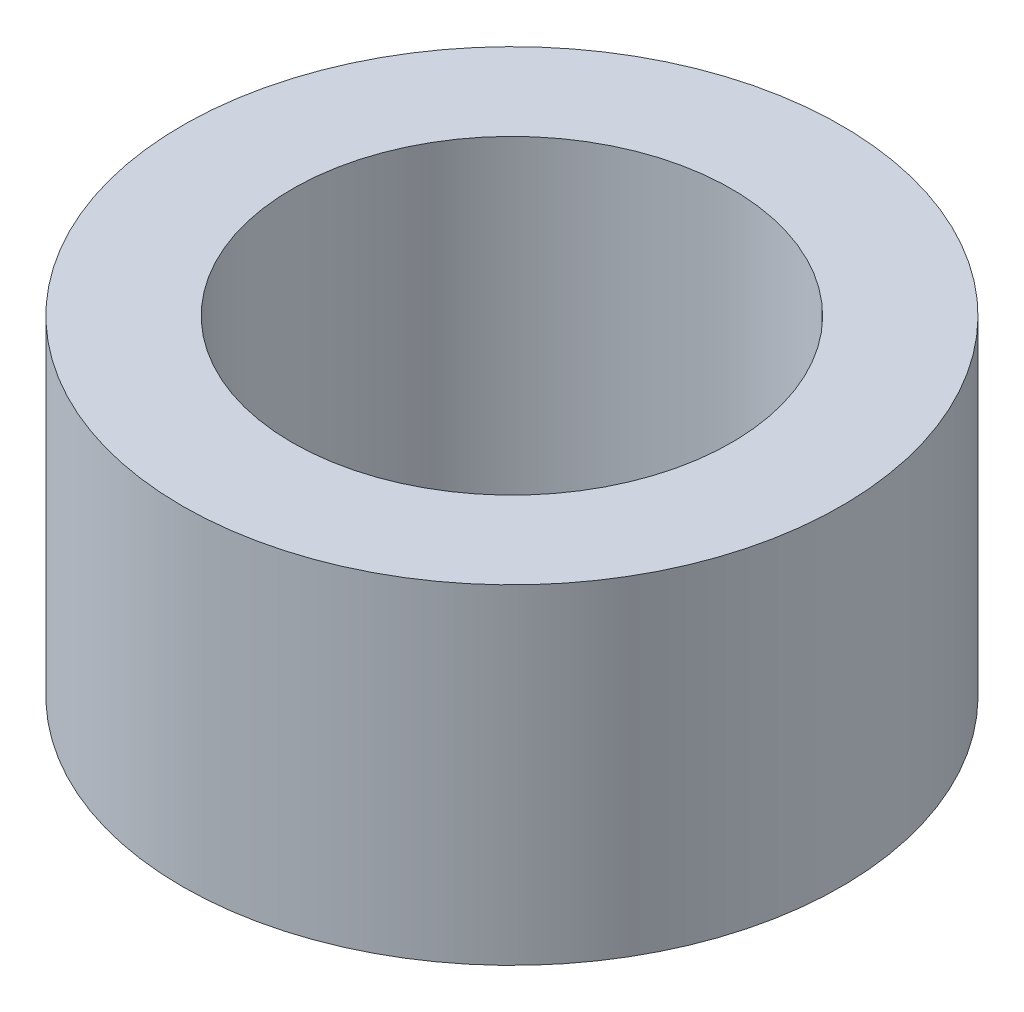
ISO-10303-21;
HEADER;
FILE_DESCRIPTION(('STEP AP214'),'2;1');
FILE_NAME('part.step','',(''),(''),'','','');
FILE_SCHEMA(('AUTOMOTIVE_DESIGN { 1 0 10303 214 1 1 1 1 }'));
ENDSEC;
DATA;
#1=APPLICATION_CONTEXT('core data for automotive mechanical design processes');
#2=APPLICATION_PROTOCOL_DEFINITION('international standard','automotive_design',2000,#1);
#3=PRODUCT_CONTEXT('',#1,'mechanical');
#4=PRODUCT('Part','Part','',(#3));
#5=PRODUCT_RELATED_PRODUCT_CATEGORY('part','',(#4));
#6=PRODUCT_DEFINITION_FORMATION('','',#4);
#7=PRODUCT_DEFINITION_CONTEXT('part definition',#1,'design');
#8=PRODUCT_DEFINITION('design','',#6,#7);
#9=PRODUCT_DEFINITION_SHAPE('','',#8);
#10=(LENGTH_UNIT() NAMED_UNIT(*) SI_UNIT(.MILLI.,.METRE.));
#11=(NAMED_UNIT(*) PLANE_ANGLE_UNIT() SI_UNIT($,.RADIAN.));
#12=(NAMED_UNIT(*) SI_UNIT($,.STERADIAN.) SOLID_ANGLE_UNIT());
#13=UNCERTAINTY_MEASURE_WITH_UNIT(LENGTH_MEASURE(1.E-05),#10,'distance_accuracy_value','');
#14=(GEOMETRIC_REPRESENTATION_CONTEXT(3) GLOBAL_UNCERTAINTY_ASSIGNED_CONTEXT((#13)) GLOBAL_UNIT_ASSIGNED_CONTEXT((#10,
#11,#12)) REPRESENTATION_CONTEXT('',''));
#15=CARTESIAN_POINT('',(0.,0.,0.));
#16=DIRECTION('',(0.,0.,1.));
#17=DIRECTION('',(1.,0.,0.));
#18=AXIS2_PLACEMENT_3D('',#15,#16,#17);
#19=CARTESIAN_POINT('',(0.,1.5,0.));
#20=DIRECTION('',(0.,1.,0.));
#21=DIRECTION('',(0.,0.,1.));
#22=AXIS2_PLACEMENT_3D('',#19,#20,#21);
#23=PLANE('',#22);
#24=CARTESIAN_POINT('',(0.,1.5,0.));
#25=DIRECTION('',(0.,1.,0.));
#26=DIRECTION('',(0.,0.,1.));
#27=AXIS2_PLACEMENT_3D('',#24,#25,#26);
#28=CIRCLE('',#27,1.5);
#29=CARTESIAN_POINT('',(0.,1.5,1.5));
#30=VERTEX_POINT('',#29);
#31=EDGE_CURVE('E10',#30,#30,#28,.T.);
#32=ORIENTED_EDGE('',*,*,#31,.T.);
#33=EDGE_LOOP('',(#32));
#34=FACE_BOUND('',#33,.T.);
#35=CARTESIAN_POINT('',(0.,1.5,0.));
#36=DIRECTION('',(0.,1.,0.));
#37=DIRECTION('',(0.,0.,1.));
#38=AXIS2_PLACEMENT_3D('',#35,#36,#37);
#39=CIRCLE('',#38,1.);
#40=CARTESIAN_POINT('',(0.,1.5,1.));
#41=VERTEX_POINT('',#40);
#42=EDGE_CURVE('E44',#41,#41,#39,.T.);
#43=ORIENTED_EDGE('',*,*,#42,.F.);
#44=EDGE_LOOP('',(#43));
#45=FACE_BOUND('',#44,.T.);
#46=ADVANCED_FACE('F33',(#34,#45),#23,.T.);
#47=CARTESIAN_POINT('',(0.,0.,0.));
#48=DIRECTION('',(0.,1.,0.));
#49=DIRECTION('',(0.,0.,1.));
#50=AXIS2_PLACEMENT_3D('',#47,#48,#49);
#51=PLANE('',#50);
#52=CARTESIAN_POINT('',(0.,0.,0.));
#53=DIRECTION('',(0.,1.,0.));
#54=DIRECTION('',(0.,0.,1.));
#55=AXIS2_PLACEMENT_3D('',#52,#53,#54);
#56=CIRCLE('',#55,1.5);
#57=CARTESIAN_POINT('',(0.,0.,1.5));
#58=VERTEX_POINT('',#57);
#59=EDGE_CURVE('E37',#58,#58,#56,.T.);
#60=ORIENTED_EDGE('',*,*,#59,.F.);
#61=EDGE_LOOP('',(#60));
#62=FACE_BOUND('',#61,.T.);
#63=CARTESIAN_POINT('',(0.,0.,0.));
#64=DIRECTION('',(0.,1.,0.));
#65=DIRECTION('',(0.,0.,1.));
#66=AXIS2_PLACEMENT_3D('',#63,#64,#65);
#67=CIRCLE('',#66,1.);
#68=CARTESIAN_POINT('',(0.,0.,1.));
#69=VERTEX_POINT('',#68);
#70=EDGE_CURVE('E46',#69,#69,#67,.T.);
#71=ORIENTED_EDGE('',*,*,#70,.T.);
#72=EDGE_LOOP('',(#71));
#73=FACE_BOUND('',#72,.T.);
#74=ADVANCED_FACE('F56',(#62,#73),#51,.F.);
#75=CARTESIAN_POINT('',(0.,1.5,0.));
#76=DIRECTION('',(0.,-1.,0.));
#77=DIRECTION('',(0.,0.,-1.));
#78=AXIS2_PLACEMENT_3D('',#75,#76,#77);
#79=CYLINDRICAL_SURFACE('',#78,1.5);
#80=ORIENTED_EDGE('',*,*,#31,.F.);
#81=EDGE_LOOP('',(#80));
#82=FACE_BOUND('',#81,.T.);
#83=ORIENTED_EDGE('',*,*,#59,.T.);
#84=EDGE_LOOP('',(#83));
#85=FACE_BOUND('',#84,.T.);
#86=ADVANCED_FACE('F35',(#82,#85),#79,.T.);
#87=CARTESIAN_POINT('',(0.,1.5,0.));
#88=DIRECTION('',(0.,-1.,0.));
#89=DIRECTION('',(0.,0.,-1.));
#90=AXIS2_PLACEMENT_3D('',#87,#88,#89);
#91=CYLINDRICAL_SURFACE('',#90,1.);
#92=ORIENTED_EDGE('',*,*,#42,.T.);
#93=EDGE_LOOP('',(#92));
#94=FACE_BOUND('',#93,.T.);
#95=ORIENTED_EDGE('',*,*,#70,.F.);
#96=EDGE_LOOP('',(#95));
#97=FACE_BOUND('',#96,.T.);
#98=ADVANCED_FACE('F52',(#94,#97),#91,.F.);
#99=CLOSED_SHELL('',(#46,#74,#86,#98));
#100=MANIFOLD_SOLID_BREP('B2',#99);
#101=ADVANCED_BREP_SHAPE_REPRESENTATION('',(#18,#100),#14);
#102=SHAPE_DEFINITION_REPRESENTATION(#9,#101);
ENDSEC;
END-ISO-10303-21;
